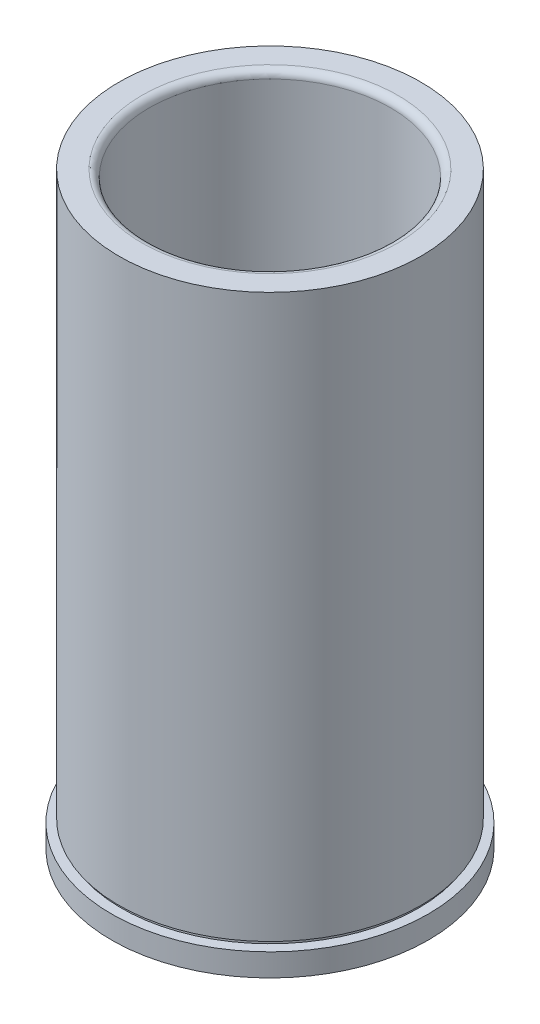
from build123d import *

# Parameters (mm, degrees)
FILLET1_R = 1.524


with BuildPart() as part:
    # Sketch1 → Revolve1 (revolve)
    with BuildSketch(Plane.XY, mode=Mode.PRIVATE) as revolve1_sk:
        with BuildLine():
            Line((-25.40635, 123.825), (-25.40635, 22.225))
            ThreePointArc((-25.40635, 22.225), (-26.304375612, 21.853025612), (-26.67635, 20.955))
            Line((-26.67635, 20.955), (-26.67635, 1.27))
            Line((-26.67635, 1.27), (-27.94635, 0))
            Line((-27.94635, 0), (-33.3375, 0))
            Line((-33.3375, 0), (-33.3375, 4.7625))
            Line((-33.3375, 4.7625), (-31.24835, 4.7625))
            Line((-31.24835, 4.7625), (-31.24835, 5.5245))
            Line((-31.24835, 5.5245), (-31.75635, 5.5245))
            Line((-31.75635, 5.5245), (-31.75635, 123.825))
            Line((-31.75635, 123.825), (-25.40635, 123.825))
        make_face()
    revolve(revolve1_sk.sketch.rotate(Axis((0, -1000, 0), (0, 1, 0)), 180), axis=Axis((0, -1000, 0), (0, 1, 0)))

    # Fillet1
    fillet1_edges = [part.edges().sort_by_distance(p)[0] for p in [
        (-25.40635, 123.825, 0),
    ]]
    fillet(fillet1_edges, radius=FILLET1_R)


solid = part.part
